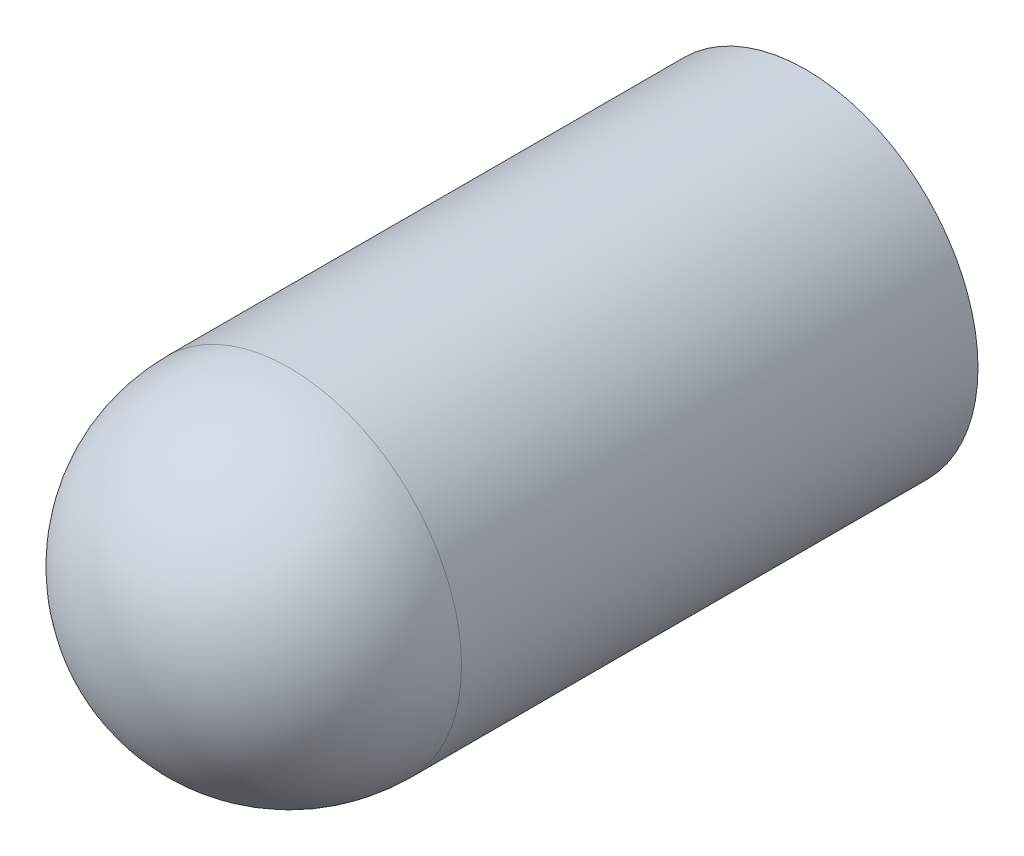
from build123d import *

# Parameters (mm, degrees)
SKETCH1_R      = 10
EXTRUDE1_DEPTH = 40
FILLET1_R      = 10


with BuildPart() as part:
    # Sketch1 → Extrude1 (new body)
    with BuildSketch(Plane.XY):
        Circle(SKETCH1_R)
    extrude(amount=EXTRUDE1_DEPTH)

    # Fillet1
    fillet1_edges = [part.edges().sort_by_distance(p)[0] for p in [
        (-10, 0, 40),
    ]]
    fillet(fillet1_edges, radius=FILLET1_R)


solid = part.part
